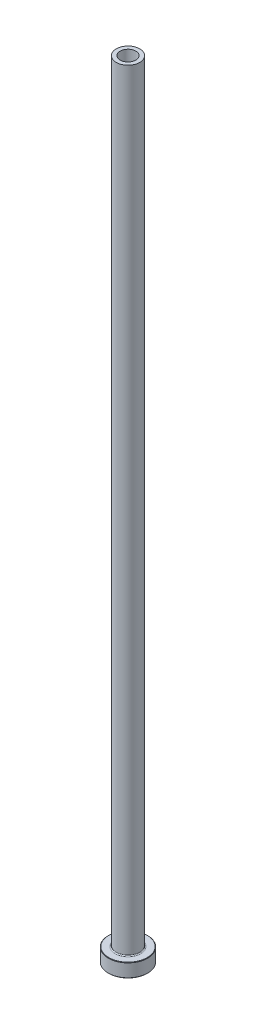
from build123d import *

# Parameters (mm, degrees)
FILLET1_R     = 0.5
CHAMFER1_SIZE = 0.2
CHAMFER3_SIZE = 0.5


with BuildPart() as part:
    # Sketch1 → Revolve1 (revolve)
    with BuildSketch(Plane.XY, mode=Mode.PRIVATE) as revolve1_sk:
        Polygon((-4, 400), (-6, 400), (-6, 7), (-10, 7), (-10, 0), (-4.25, 0), (-4.25, 343), (-4, 355), align=None)
    revolve(revolve1_sk.sketch.rotate(Axis((0, 92.187680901, 0), (0, -1, 0)), 270), axis=Axis((0, 92.187680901, 0), (0, -1, 0)))

    # Fillet1
    fillet1_edges = [part.edges().sort_by_distance(p)[0] for p in [
        (0, 7, -6),
    ]]
    fillet(fillet1_edges, radius=FILLET1_R)

    # Chamfer1
    chamfer1_edges = [part.edges().sort_by_distance(p)[0] for p in [
        (0, 0, -10),
        (0, 7, -10),
    ]]
    chamfer(chamfer1_edges, length=CHAMFER1_SIZE)

    # Chamfer3
    chamfer3_edges = [part.edges().sort_by_distance(p)[0] for p in [
        (0, 0, -4.25),
    ]]
    chamfer(chamfer3_edges, length=CHAMFER3_SIZE)


solid = part.part
